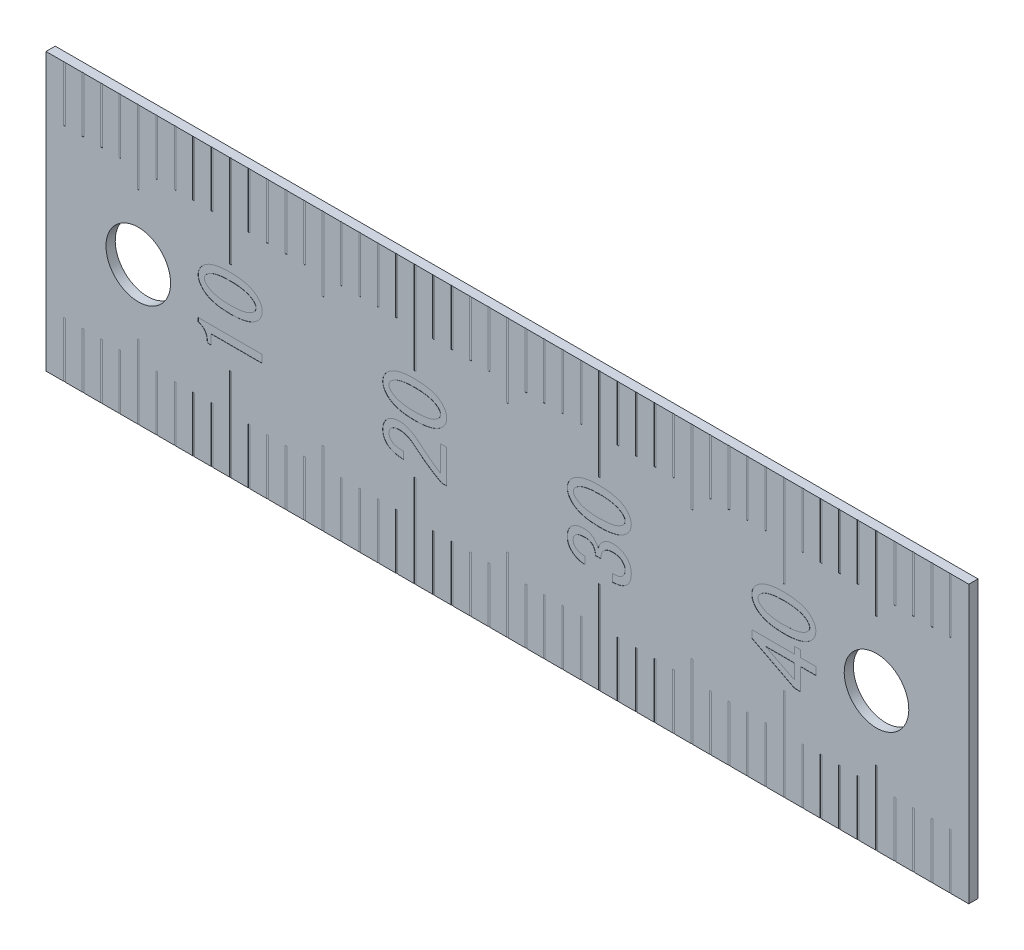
from build123d import *

# Parameters (mm, degrees)
SKETCH1_W             = 15
SKETCH1_H             = 50
EXTRUDE1_DEPTH        = 0.5
SKETCH2_R             = 1.75
EXTRUDE2_DEPTH        = 53.203927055
EXTRUDE3_DEPTH        = 0.01
SKETCH4_W             = 5
SKETCH4_H             = 0.1
SKETCH4_W_2           = 3
SKETCH4_W_3           = 4
EXTRUDE4_DEPTH        = 0.01
BODY_MOVE_COPY2_ANGLE = 90


with BuildPart() as part:
    # Sketch1 → Extrude1 (new body)
    with BuildSketch(Plane.XY):
        with Locations((7.5, 25)):
            Rectangle(SKETCH1_W, SKETCH1_H)
    extrude(amount=EXTRUDE1_DEPTH)

    # Sketch2 → Extrude2 (cut, through all)
    with BuildSketch(Plane.XY.offset(0.5)):
        with Locations((7.5, 5)):
            Circle(SKETCH2_R)
        with Locations((7.5, 45)):
            Circle(SKETCH2_R)
    extrude(amount=-EXTRUDE2_DEPTH, mode=Mode.SUBTRACT)

    # Sketch3 → Extrude3 (cut)
    # profile 1 of 8: a face of its own
    with BuildSketch(Plane.XY.offset(0.5)):
        with BuildLine():
            Line((6.216949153, 38.286911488), (6.216949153, 39.673728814))
            Line((6.216949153, 39.673728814), (6.216949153, 41.047363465))
            Line((6.216949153, 41.047363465), (5.694915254, 41.047363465))
            Line((5.694915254, 41.047363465), (5.694915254, 41.257627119))
            add(Edge.make_bspline(
                [(5.694915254, 41.257627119), (5.720192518, 41.257994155), (5.769501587, 41.258710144), (5.841506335, 41.264639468), (5.909427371, 41.274751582), (5.973597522, 41.287199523), (6.033192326, 41.305760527), (6.089497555, 41.326036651), (6.140930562, 41.352332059), (6.188863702, 41.381188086), (6.232582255, 41.414355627), (6.272352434, 41.451440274), (6.308137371, 41.492533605), (6.339819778, 41.537640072), (6.367821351, 41.586476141), (6.390300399, 41.6396652), (6.41097118, 41.695912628), (6.419965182, 41.735590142), (6.424576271, 41.755932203)],
                knots=[0, 0, 0, 0, 1.25074981, 2.439872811, 3.57154149, 4.648346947, 5.66994637, 6.657420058, 7.60556447, 8.522977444, 9.423221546, 10.315552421, 11.209471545, 12.114430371, 13.03954205, 13.988932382, 14.968956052, 16, 16, 16, 16], degree=3))
            Line((6.424576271, 41.755932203), (6.638135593, 41.755932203))
            Line((6.638135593, 41.755932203), (6.638135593, 38.286911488))
            Line((6.638135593, 38.286911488), (6.216949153, 38.286911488))
        make_face()
    # profile 2 of 8: a face of its own
    with BuildSketch(Plane.XY.offset(0.5)):
        with BuildLine():
            add(Edge.make_bspline(
                [(7.670338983, 40.029661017), (7.670829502, 40.072507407), (7.671793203, 40.156685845), (7.676090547, 40.280686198), (7.684705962, 40.399825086), (7.696795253, 40.514071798), (7.710795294, 40.623684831), (7.729370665, 40.728309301), (7.751095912, 40.828149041), (7.77597959, 40.922993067), (7.804365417, 41.012966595), (7.836057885, 41.098089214), (7.870573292, 41.178755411), (7.909950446, 41.253817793), (7.951116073, 41.324637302), (7.996213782, 41.390336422), (8.044897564, 41.450979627), (8.080073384, 41.488323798), (8.097457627, 41.506779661)],
                knots=[0, 0, 0, 0, 1.305427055, 2.564715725, 3.779397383, 4.943659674, 6.064530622, 7.145206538, 8.1798118, 9.17670212, 10.131464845, 11.052792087, 11.943155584, 12.802378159, 13.633530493, 14.437472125, 15.227783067, 16, 16, 16, 16], degree=3))
            add(Edge.make_bspline(
                [(8.097457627, 41.506779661), (8.118189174, 41.526742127), (8.158560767, 41.565616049), (8.223990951, 41.6159742), (8.29062965, 41.658865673), (8.358609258, 41.695138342), (8.429073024, 41.722269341), (8.501187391, 41.741138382), (8.574673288, 41.753722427), (8.624274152, 41.755194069), (8.649152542, 41.755932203)],
                knots=[0, 0, 0, 0, 1.110117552, 2.161788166, 3.18031983, 4.16653166, 5.130321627, 6.086809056, 7.040397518, 8, 8, 8, 8], degree=3))
            add(Edge.make_bspline(
                [(8.649152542, 41.755932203), (8.674030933, 41.755194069), (8.723631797, 41.753722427), (8.797117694, 41.741138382), (8.869232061, 41.722269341), (8.939695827, 41.695138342), (9.007675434, 41.658865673), (9.074314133, 41.6159742), (9.139744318, 41.565616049), (9.18011591, 41.526742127), (9.200847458, 41.506779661)],
                knots=[0, 0, 0, 0, 0.959602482, 1.913190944, 2.869678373, 3.83346834, 4.81968017, 5.838211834, 6.889882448, 8, 8, 8, 8], degree=3))
            add(Edge.make_bspline(
                [(9.200847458, 41.506779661), (9.218227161, 41.488321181), (9.253393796, 41.450971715), (9.302148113, 41.39036917), (9.347032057, 41.324417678), (9.389280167, 41.254207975), (9.427522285, 41.17853116), (9.462317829, 41.098126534), (9.493918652, 41.012955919), (9.522335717, 40.922996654), (9.547189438, 40.828145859), (9.569006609, 40.728318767), (9.587229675, 40.623619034), (9.602638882, 40.514179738), (9.613279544, 40.399768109), (9.622305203, 40.280696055), (9.626487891, 40.156683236), (9.62746749, 40.072506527), (9.627966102, 40.029661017)],
                knots=[0, 0, 0, 0, 0.772188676, 1.562470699, 2.366382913, 3.20092084, 4.057056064, 4.947386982, 5.868680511, 6.823408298, 7.82026214, 8.854829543, 9.935465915, 11.057194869, 12.220740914, 13.435378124, 14.694620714, 16, 16, 16, 16], degree=3))
            add(Edge.make_bspline(
                [(9.627966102, 40.029661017), (9.627467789, 39.985936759), (9.62649093, 39.900222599), (9.622328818, 39.774232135), (9.613247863, 39.653405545), (9.602616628, 39.537241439), (9.587362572, 39.426237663), (9.568912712, 39.320259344), (9.547201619, 39.219315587), (9.522309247, 39.123160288), (9.494041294, 39.032051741), (9.462303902, 38.946046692), (9.427521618, 38.864982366), (9.389289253, 38.788641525), (9.347004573, 38.717800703), (9.302346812, 38.651238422), (9.253373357, 38.590568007), (9.218220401, 38.553208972), (9.200847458, 38.534745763)],
                knots=[0, 0, 0, 0, 1.317726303, 2.583183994, 3.797878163, 4.968595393, 6.097857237, 7.173314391, 8.20962062, 9.208490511, 10.165515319, 11.083041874, 11.969809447, 12.822581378, 13.653772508, 14.454446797, 15.23617212, 16, 16, 16, 16], degree=3))
            add(Edge.make_bspline(
                [(9.200847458, 38.534745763), (9.180085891, 38.515033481), (9.139553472, 38.476549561), (9.074305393, 38.426244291), (9.007859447, 38.383179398), (8.939507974, 38.347848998), (8.869256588, 38.320526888), (8.797111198, 38.30171788), (8.723633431, 38.289118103), (8.674031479, 38.287648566), (8.649152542, 38.286911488)],
                knots=[0, 0, 0, 0, 1.105704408, 2.15864601, 3.178408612, 4.161898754, 5.126853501, 6.084496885, 7.039237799, 8, 8, 8, 8], degree=3))
            add(Edge.make_bspline(
                [(8.649152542, 38.286911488), (8.624273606, 38.287648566), (8.574671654, 38.289118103), (8.501193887, 38.30171788), (8.429048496, 38.320526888), (8.358797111, 38.347848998), (8.290445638, 38.383179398), (8.223999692, 38.426244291), (8.158751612, 38.476549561), (8.118219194, 38.515033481), (8.097457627, 38.534745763)],
                knots=[0, 0, 0, 0, 0.960762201, 1.915503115, 2.873146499, 3.838101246, 4.821591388, 5.84135399, 6.894295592, 8, 8, 8, 8], degree=3))
            add(Edge.make_bspline(
                [(8.097457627, 38.534745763), (8.080080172, 38.553206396), (8.044918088, 38.590560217), (7.996014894, 38.65127076), (7.951141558, 38.717581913), (7.909944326, 38.789029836), (7.870572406, 38.864759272), (7.836072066, 38.946083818), (7.804242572, 39.032041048), (7.77600611, 39.123163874), (7.751083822, 39.219312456), (7.729463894, 39.320268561), (7.71066559, 39.426173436), (7.696818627, 39.537347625), (7.684739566, 39.65334975), (7.67606663, 39.77424179), (7.671790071, 39.900220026), (7.67082916, 39.98593589), (7.670338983, 40.029661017)],
                knots=[0, 0, 0, 0, 0.763855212, 1.545608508, 2.346311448, 3.174176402, 4.029980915, 4.916780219, 5.834339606, 6.79139866, 7.790304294, 8.826647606, 9.902143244, 11.030571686, 12.201985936, 13.416723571, 14.682226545, 16, 16, 16, 16], degree=3))
        make_face()
        with BuildLine():
            add(Edge.make_bspline(
                [(9.218644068, 40.029661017), (9.218401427, 40.06811401), (9.217925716, 40.143502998), (9.213890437, 40.254274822), (9.207394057, 40.36043931), (9.19820924, 40.461995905), (9.186467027, 40.558736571), (9.171997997, 40.650645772), (9.154788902, 40.737919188), (9.135417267, 40.820493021), (9.112729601, 40.898295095), (9.087786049, 40.971360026), (9.060527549, 41.040128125), (9.029099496, 41.103353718), (8.996371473, 41.162419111), (8.960630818, 41.216569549), (8.922584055, 41.266432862), (8.894393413, 41.296304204), (8.880508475, 41.311016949)],
                knots=[0, 0, 0, 0, 1.361121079, 2.668545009, 3.923107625, 5.125754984, 6.277561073, 7.372066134, 8.418398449, 9.425734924, 10.373324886, 11.2857946, 12.158104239, 12.989405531, 13.783340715, 14.546945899, 15.284316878, 16, 16, 16, 16], degree=3))
            add(Edge.make_bspline(
                [(8.880508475, 41.311016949), (8.862804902, 41.327301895), (8.828895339, 41.358494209), (8.771271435, 41.392758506), (8.711034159, 41.414027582), (8.669751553, 41.416541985), (8.649152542, 41.41779661)],
                knots=[0, 0, 0, 0, 1.101426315, 2.109680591, 3.056776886, 4, 4, 4, 4], degree=3))
            add(Edge.make_bspline(
                [(8.649152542, 41.41779661), (8.628553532, 41.416541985), (8.587270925, 41.414027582), (8.52703365, 41.392758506), (8.469409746, 41.358494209), (8.435500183, 41.327301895), (8.41779661, 41.311016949)],
                knots=[0, 0, 0, 0, 0.943223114, 1.890319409, 2.898573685, 4, 4, 4, 4], degree=3))
            add(Edge.make_bspline(
                [(8.41779661, 41.311016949), (8.403943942, 41.295612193), (8.375924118, 41.264452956), (8.337429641, 41.213183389), (8.302154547, 41.157195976), (8.269141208, 41.096778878), (8.238105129, 41.032500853), (8.210344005, 40.963298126), (8.185591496, 40.889711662), (8.163077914, 40.811655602), (8.143495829, 40.72935949), (8.126232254, 40.642529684), (8.111958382, 40.551250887), (8.100069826, 40.455410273), (8.090947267, 40.355384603), (8.084385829, 40.25076225), (8.080392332, 40.141745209), (8.07990761, 40.067454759), (8.079661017, 40.029661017)],
                knots=[0, 0, 0, 0, 0.733849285, 1.48435867, 2.268363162, 3.076728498, 3.92289974, 4.796109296, 5.716889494, 6.672935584, 7.673739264, 8.713513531, 9.809147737, 10.946688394, 12.135070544, 13.36761715, 14.660829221, 16, 16, 16, 16], degree=3))
            add(Edge.make_bspline(
                [(8.079661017, 40.029661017), (8.079901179, 39.99032918), (8.080370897, 39.913402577), (8.084420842, 39.800434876), (8.090885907, 39.692511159), (8.100090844, 39.589417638), (8.111903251, 39.491150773), (8.126256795, 39.397688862), (8.14342239, 39.309080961), (8.163018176, 39.225467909), (8.185450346, 39.146714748), (8.21053616, 39.072812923), (8.237777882, 39.003387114), (8.269201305, 38.93949489), (8.301960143, 38.879799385), (8.3374802, 38.825046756), (8.375740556, 38.775105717), (8.403918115, 38.745225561), (8.41779661, 38.730508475)],
                knots=[0, 0, 0, 0, 1.374671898, 2.688632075, 3.950368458, 5.153146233, 6.305673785, 7.409137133, 8.457347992, 9.459453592, 10.409852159, 11.318084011, 12.186518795, 13.014240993, 13.804868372, 14.565269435, 15.2933419, 16, 16, 16, 16], degree=3))
            add(Edge.make_bspline(
                [(8.41779661, 38.730508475), (8.43545363, 38.714135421), (8.469192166, 38.68285025), (8.527371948, 38.649736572), (8.587110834, 38.627272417), (8.628524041, 38.624907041), (8.649152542, 38.623728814)],
                knots=[0, 0, 0, 0, 1.101932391, 2.105541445, 3.0563435, 4, 4, 4, 4], degree=3))
            add(Edge.make_bspline(
                [(8.649152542, 38.623728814), (8.669781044, 38.624907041), (8.711194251, 38.627272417), (8.770933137, 38.649736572), (8.829112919, 38.68285025), (8.862851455, 38.714135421), (8.880508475, 38.730508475)],
                knots=[0, 0, 0, 0, 0.9436565, 1.894458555, 2.898067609, 4, 4, 4, 4], degree=3))
            add(Edge.make_bspline(
                [(8.880508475, 38.730508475), (8.894386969, 38.745225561), (8.922564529, 38.775105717), (8.960824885, 38.825046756), (8.996344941, 38.879799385), (9.02910378, 38.93949489), (9.060527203, 39.003387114), (9.087768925, 39.072812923), (9.112854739, 39.146714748), (9.135286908, 39.225467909), (9.154882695, 39.309080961), (9.17204829, 39.397688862), (9.186401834, 39.491150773), (9.198214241, 39.589417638), (9.207419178, 39.692511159), (9.213884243, 39.800434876), (9.217934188, 39.913402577), (9.218403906, 39.99032918), (9.218644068, 40.029661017)],
                knots=[0, 0, 0, 0, 0.7066581, 1.434730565, 2.195131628, 2.985759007, 3.813481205, 4.681915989, 5.590147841, 6.540546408, 7.542652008, 8.590862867, 9.694326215, 10.846853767, 12.049631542, 13.311367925, 14.625328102, 16, 16, 16, 16], degree=3))
        make_face(mode=Mode.SUBTRACT)
    # profile 3 of 8: a face of its own
    with BuildSketch(Plane.XY.offset(0.5)):
        with BuildLine():
            Line((7.278813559, 28.623728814), (7.278813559, 28.286911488))
            Line((7.278813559, 28.286911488), (5.463559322, 28.286911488))
            Line((5.463559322, 28.286911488), (5.463559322, 28.570338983))
            add(Edge.make_bspline(
                [(5.463559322, 28.570338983), (5.498324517, 28.634054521), (5.567960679, 28.761679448), (5.6797878, 28.949763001), (5.797762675, 29.135242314), (5.921134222, 29.319023), (6.051060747, 29.500356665), (6.187539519, 29.679151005), (6.329169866, 29.856558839), (6.428173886, 29.971735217), (6.477966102, 30.029661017)],
                knots=[0, 0, 0, 0, 0.978031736, 1.959039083, 2.947962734, 3.93993095, 4.941489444, 5.953491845, 6.970747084, 8, 8, 8, 8], degree=3))
            add(Edge.make_bspline(
                [(6.477966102, 30.029661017), (6.504874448, 30.061981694), (6.557570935, 30.125277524), (6.625963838, 30.22552891), (6.685342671, 30.326165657), (6.73277714, 30.428761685), (6.770085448, 30.531939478), (6.79666245, 30.636312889), (6.813029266, 30.741883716), (6.815078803, 30.81287462), (6.816101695, 30.848305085)],
                knots=[0, 0, 0, 0, 1.114457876, 2.182520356, 3.213612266, 4.209190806, 5.174713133, 6.118499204, 7.060971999, 8, 8, 8, 8], degree=3))
            add(Edge.make_bspline(
                [(6.816101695, 30.848305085), (6.815559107, 30.872710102), (6.814500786, 30.920312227), (6.807348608, 30.989563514), (6.795005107, 31.054485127), (6.777072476, 31.114656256), (6.754722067, 31.170714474), (6.726863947, 31.222057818), (6.694761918, 31.269704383), (6.668847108, 31.297276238), (6.655932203, 31.311016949)],
                knots=[0, 0, 0, 0, 1.165236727, 2.272800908, 3.320045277, 4.315844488, 5.266523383, 6.195893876, 7.100905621, 8, 8, 8, 8], degree=3))
            add(Edge.make_bspline(
                [(6.655932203, 31.311016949), (6.637239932, 31.327523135), (6.599842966, 31.360546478), (6.531033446, 31.394311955), (6.453848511, 31.414407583), (6.399440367, 31.416638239), (6.371186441, 31.41779661)],
                knots=[0, 0, 0, 0, 0.955281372, 1.911197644, 2.915293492, 4, 4, 4, 4], degree=3))
            add(Edge.make_bspline(
                [(6.371186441, 31.41779661), (6.347195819, 31.416178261), (6.297727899, 31.412841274), (6.225461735, 31.382877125), (6.152812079, 31.338256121), (6.109457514, 31.297213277), (6.086440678, 31.275423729)],
                knots=[0, 0, 0, 0, 0.878616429, 1.811679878, 2.838226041, 4, 4, 4, 4], degree=3))
            add(Edge.make_bspline(
                [(6.086440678, 31.275423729), (6.073340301, 31.260682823), (6.045878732, 31.229782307), (6.014541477, 31.172297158), (5.986374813, 31.105787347), (5.964776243, 31.028130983), (5.94696429, 30.940279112), (5.93484749, 30.841778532), (5.927790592, 30.732841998), (5.926792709, 30.656728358), (5.926271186, 30.616949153)],
                knots=[0, 0, 0, 0, 0.681736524, 1.429085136, 2.255271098, 3.183361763, 4.217126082, 5.361292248, 6.620934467, 8, 8, 8, 8], degree=3))
            Line((5.926271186, 30.616949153), (5.534745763, 30.616949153))
            add(Edge.make_bspline(
                [(5.534745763, 30.616949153), (5.536884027, 30.66863478), (5.541007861, 30.768315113), (5.558612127, 30.912051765), (5.583001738, 31.044849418), (5.616433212, 31.166713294), (5.65853644, 31.277386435), (5.708899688, 31.377100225), (5.76680797, 31.466726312), (5.814114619, 31.517500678), (5.837288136, 31.542372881)],
                knots=[0, 0, 0, 0, 1.245503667, 2.402064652, 3.484583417, 4.495008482, 5.441434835, 6.331296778, 7.18257321, 8, 8, 8, 8], degree=3))
            add(Edge.make_bspline(
                [(5.837288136, 31.542372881), (5.855355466, 31.559530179), (5.891481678, 31.59383675), (5.952345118, 31.636812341), (6.017267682, 31.673649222), (6.086296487, 31.704053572), (6.160486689, 31.726963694), (6.23848039, 31.744157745), (6.321272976, 31.754149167), (6.377750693, 31.755326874), (6.406779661, 31.755932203)],
                knots=[0, 0, 0, 0, 0.956098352, 1.911749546, 2.852903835, 3.820445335, 4.802783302, 5.830866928, 6.885087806, 8, 8, 8, 8], degree=3))
            add(Edge.make_bspline(
                [(6.406779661, 31.755932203), (6.434511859, 31.755465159), (6.488898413, 31.754549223), (6.568647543, 31.742396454), (6.645518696, 31.725279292), (6.718634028, 31.699145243), (6.788555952, 31.666787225), (6.854994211, 31.626731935), (6.918272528, 31.579565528), (6.956845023, 31.542994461), (6.976271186, 31.524576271)],
                knots=[0, 0, 0, 0, 1.052697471, 2.0644807, 3.058754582, 4.040933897, 5.00824168, 5.981797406, 6.983577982, 8, 8, 8, 8], degree=3))
            add(Edge.make_bspline(
                [(6.976271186, 31.524576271), (6.996442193, 31.503333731), (7.036747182, 31.460887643), (7.086228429, 31.387922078), (7.129704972, 31.310266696), (7.165542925, 31.226217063), (7.192177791, 31.135640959), (7.211123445, 31.039204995), (7.223336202, 30.93694094), (7.224716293, 30.866577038), (7.225423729, 30.830508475)],
                knots=[0, 0, 0, 0, 0.926985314, 1.852269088, 2.78426235, 3.745226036, 4.741005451, 5.770682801, 6.857251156, 8, 8, 8, 8], degree=3))
            add(Edge.make_bspline(
                [(7.225423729, 30.830508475), (7.224123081, 30.78711896), (7.22149698, 30.699512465), (7.196723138, 30.568153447), (7.15916462, 30.435936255), (7.106444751, 30.302352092), (7.03809091, 30.168153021), (6.955017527, 30.032587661), (6.857509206, 29.895754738), (6.783147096, 29.80788724), (6.744915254, 29.762711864)],
                knots=[0, 0, 0, 0, 0.869828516, 1.756245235, 2.673055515, 3.625149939, 4.632616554, 5.691117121, 6.812932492, 8, 8, 8, 8], degree=3))
            add(Edge.make_bspline(
                [(6.744915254, 29.762711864), (6.702546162, 29.714094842), (6.618868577, 29.618077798), (6.498015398, 29.472973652), (6.383790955, 29.32848106), (6.273558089, 29.186027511), (6.170111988, 29.043752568), (6.070683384, 28.903421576), (5.977731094, 28.76382659), (5.919441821, 28.670019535), (5.890677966, 28.623728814)],
                knots=[0, 0, 0, 0, 1.085774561, 2.144369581, 3.179090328, 4.186843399, 5.176841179, 6.140565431, 7.082429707, 8, 8, 8, 8], degree=3))
            Line((5.890677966, 28.623728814), (7.278813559, 28.623728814))
        make_face()
    # profile 4 of 8: a face of its own
    with BuildSketch(Plane.XY.offset(0.5)):
        with BuildLine():
            add(Edge.make_bspline(
                [(7.670338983, 30.029661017), (7.670829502, 30.072507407), (7.671793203, 30.156685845), (7.676090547, 30.280686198), (7.684705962, 30.399825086), (7.696795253, 30.514071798), (7.710795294, 30.623684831), (7.729370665, 30.728309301), (7.751095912, 30.828149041), (7.77597959, 30.922993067), (7.804365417, 31.012966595), (7.836057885, 31.098089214), (7.870573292, 31.178755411), (7.909950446, 31.253817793), (7.951116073, 31.324637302), (7.996213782, 31.390336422), (8.044897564, 31.450979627), (8.080073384, 31.488323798), (8.097457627, 31.506779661)],
                knots=[0, 0, 0, 0, 1.305427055, 2.564715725, 3.779397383, 4.943659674, 6.064530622, 7.145206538, 8.1798118, 9.17670212, 10.131464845, 11.052792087, 11.943155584, 12.802378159, 13.633530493, 14.437472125, 15.227783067, 16, 16, 16, 16], degree=3))
            add(Edge.make_bspline(
                [(8.097457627, 31.506779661), (8.118189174, 31.526742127), (8.158560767, 31.565616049), (8.223990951, 31.6159742), (8.29062965, 31.658865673), (8.358609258, 31.695138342), (8.429073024, 31.722269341), (8.501187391, 31.741138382), (8.574673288, 31.753722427), (8.624274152, 31.755194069), (8.649152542, 31.755932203)],
                knots=[0, 0, 0, 0, 1.110117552, 2.161788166, 3.18031983, 4.16653166, 5.130321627, 6.086809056, 7.040397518, 8, 8, 8, 8], degree=3))
            add(Edge.make_bspline(
                [(8.649152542, 31.755932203), (8.674030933, 31.755194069), (8.723631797, 31.753722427), (8.797117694, 31.741138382), (8.869232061, 31.722269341), (8.939695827, 31.695138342), (9.007675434, 31.658865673), (9.074314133, 31.6159742), (9.139744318, 31.565616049), (9.18011591, 31.526742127), (9.200847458, 31.506779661)],
                knots=[0, 0, 0, 0, 0.959602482, 1.913190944, 2.869678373, 3.83346834, 4.81968017, 5.838211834, 6.889882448, 8, 8, 8, 8], degree=3))
            add(Edge.make_bspline(
                [(9.200847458, 31.506779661), (9.218227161, 31.488321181), (9.253393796, 31.450971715), (9.302148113, 31.39036917), (9.347032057, 31.324417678), (9.389280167, 31.254207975), (9.427522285, 31.17853116), (9.462317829, 31.098126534), (9.493918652, 31.012955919), (9.522335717, 30.922996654), (9.547189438, 30.828145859), (9.569006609, 30.728318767), (9.587229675, 30.623619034), (9.602638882, 30.514179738), (9.613279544, 30.399768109), (9.622305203, 30.280696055), (9.626487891, 30.156683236), (9.62746749, 30.072506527), (9.627966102, 30.029661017)],
                knots=[0, 0, 0, 0, 0.772188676, 1.562470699, 2.366382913, 3.20092084, 4.057056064, 4.947386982, 5.868680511, 6.823408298, 7.82026214, 8.854829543, 9.935465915, 11.057194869, 12.220740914, 13.435378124, 14.694620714, 16, 16, 16, 16], degree=3))
            add(Edge.make_bspline(
                [(9.627966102, 30.029661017), (9.627467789, 29.985936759), (9.62649093, 29.900222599), (9.622328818, 29.774232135), (9.613247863, 29.653405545), (9.602616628, 29.537241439), (9.587362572, 29.426237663), (9.568912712, 29.320259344), (9.547201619, 29.219315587), (9.522309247, 29.123160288), (9.494041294, 29.032051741), (9.462303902, 28.946046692), (9.427521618, 28.864982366), (9.389289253, 28.788641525), (9.347004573, 28.717800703), (9.302346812, 28.651238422), (9.253373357, 28.590568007), (9.218220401, 28.553208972), (9.200847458, 28.534745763)],
                knots=[0, 0, 0, 0, 1.317726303, 2.583183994, 3.797878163, 4.968595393, 6.097857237, 7.173314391, 8.20962062, 9.208490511, 10.165515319, 11.083041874, 11.969809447, 12.822581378, 13.653772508, 14.454446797, 15.23617212, 16, 16, 16, 16], degree=3))
            add(Edge.make_bspline(
                [(9.200847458, 28.534745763), (9.180085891, 28.515033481), (9.139553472, 28.476549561), (9.074305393, 28.426244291), (9.007859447, 28.383179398), (8.939507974, 28.347848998), (8.869256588, 28.320526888), (8.797111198, 28.30171788), (8.723633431, 28.289118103), (8.674031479, 28.287648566), (8.649152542, 28.286911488)],
                knots=[0, 0, 0, 0, 1.105704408, 2.15864601, 3.178408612, 4.161898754, 5.126853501, 6.084496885, 7.039237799, 8, 8, 8, 8], degree=3))
            add(Edge.make_bspline(
                [(8.649152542, 28.286911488), (8.624273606, 28.287648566), (8.574671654, 28.289118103), (8.501193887, 28.30171788), (8.429048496, 28.320526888), (8.358797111, 28.347848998), (8.290445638, 28.383179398), (8.223999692, 28.426244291), (8.158751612, 28.476549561), (8.118219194, 28.515033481), (8.097457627, 28.534745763)],
                knots=[0, 0, 0, 0, 0.960762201, 1.915503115, 2.873146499, 3.838101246, 4.821591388, 5.84135399, 6.894295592, 8, 8, 8, 8], degree=3))
            add(Edge.make_bspline(
                [(8.097457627, 28.534745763), (8.080080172, 28.553206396), (8.044918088, 28.590560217), (7.996014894, 28.65127076), (7.951141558, 28.717581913), (7.909944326, 28.789029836), (7.870572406, 28.864759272), (7.836072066, 28.946083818), (7.804242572, 29.032041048), (7.77600611, 29.123163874), (7.751083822, 29.219312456), (7.729463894, 29.320268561), (7.71066559, 29.426173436), (7.696818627, 29.537347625), (7.684739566, 29.65334975), (7.67606663, 29.77424179), (7.671790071, 29.900220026), (7.67082916, 29.98593589), (7.670338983, 30.029661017)],
                knots=[0, 0, 0, 0, 0.763855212, 1.545608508, 2.346311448, 3.174176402, 4.029980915, 4.916780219, 5.834339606, 6.79139866, 7.790304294, 8.826647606, 9.902143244, 11.030571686, 12.201985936, 13.416723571, 14.682226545, 16, 16, 16, 16], degree=3))
        make_face()
        with BuildLine():
            add(Edge.make_bspline(
                [(9.218644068, 30.029661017), (9.218401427, 30.06811401), (9.217925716, 30.143502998), (9.213890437, 30.254274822), (9.207394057, 30.36043931), (9.19820924, 30.461995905), (9.186467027, 30.558736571), (9.171997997, 30.650645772), (9.154788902, 30.737919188), (9.135417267, 30.820493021), (9.112729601, 30.898295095), (9.087786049, 30.971360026), (9.060527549, 31.040128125), (9.029099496, 31.103353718), (8.996371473, 31.162419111), (8.960630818, 31.216569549), (8.922584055, 31.266432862), (8.894393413, 31.296304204), (8.880508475, 31.311016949)],
                knots=[0, 0, 0, 0, 1.361121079, 2.668545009, 3.923107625, 5.125754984, 6.277561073, 7.372066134, 8.418398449, 9.425734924, 10.373324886, 11.2857946, 12.158104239, 12.989405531, 13.783340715, 14.546945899, 15.284316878, 16, 16, 16, 16], degree=3))
            add(Edge.make_bspline(
                [(8.880508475, 31.311016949), (8.862804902, 31.327301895), (8.828895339, 31.358494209), (8.771271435, 31.392758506), (8.711034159, 31.414027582), (8.669751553, 31.416541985), (8.649152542, 31.41779661)],
                knots=[0, 0, 0, 0, 1.101426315, 2.109680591, 3.056776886, 4, 4, 4, 4], degree=3))
            add(Edge.make_bspline(
                [(8.649152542, 31.41779661), (8.628553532, 31.416541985), (8.587270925, 31.414027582), (8.52703365, 31.392758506), (8.469409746, 31.358494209), (8.435500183, 31.327301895), (8.41779661, 31.311016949)],
                knots=[0, 0, 0, 0, 0.943223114, 1.890319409, 2.898573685, 4, 4, 4, 4], degree=3))
            add(Edge.make_bspline(
                [(8.41779661, 31.311016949), (8.403943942, 31.295612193), (8.375924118, 31.264452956), (8.337429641, 31.213183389), (8.302154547, 31.157195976), (8.269141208, 31.096778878), (8.238105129, 31.032500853), (8.210344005, 30.963298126), (8.185591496, 30.889711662), (8.163077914, 30.811655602), (8.143495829, 30.72935949), (8.126232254, 30.642529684), (8.111958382, 30.551250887), (8.100069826, 30.455410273), (8.090947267, 30.355384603), (8.084385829, 30.25076225), (8.080392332, 30.141745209), (8.07990761, 30.067454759), (8.079661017, 30.029661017)],
                knots=[0, 0, 0, 0, 0.733849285, 1.48435867, 2.268363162, 3.076728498, 3.92289974, 4.796109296, 5.716889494, 6.672935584, 7.673739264, 8.713513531, 9.809147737, 10.946688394, 12.135070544, 13.36761715, 14.660829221, 16, 16, 16, 16], degree=3))
            add(Edge.make_bspline(
                [(8.079661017, 30.029661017), (8.079901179, 29.99032918), (8.080370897, 29.913402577), (8.084420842, 29.800434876), (8.090885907, 29.692511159), (8.100090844, 29.589417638), (8.111903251, 29.491150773), (8.126256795, 29.397688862), (8.14342239, 29.309080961), (8.163018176, 29.225467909), (8.185450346, 29.146714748), (8.21053616, 29.072812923), (8.237777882, 29.003387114), (8.269201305, 28.93949489), (8.301960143, 28.879799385), (8.3374802, 28.825046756), (8.375740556, 28.775105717), (8.403918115, 28.745225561), (8.41779661, 28.730508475)],
                knots=[0, 0, 0, 0, 1.374671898, 2.688632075, 3.950368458, 5.153146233, 6.305673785, 7.409137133, 8.457347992, 9.459453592, 10.409852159, 11.318084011, 12.186518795, 13.014240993, 13.804868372, 14.565269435, 15.2933419, 16, 16, 16, 16], degree=3))
            add(Edge.make_bspline(
                [(8.41779661, 28.730508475), (8.43545363, 28.714135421), (8.469192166, 28.68285025), (8.527371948, 28.649736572), (8.587110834, 28.627272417), (8.628524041, 28.624907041), (8.649152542, 28.623728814)],
                knots=[0, 0, 0, 0, 1.101932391, 2.105541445, 3.0563435, 4, 4, 4, 4], degree=3))
            add(Edge.make_bspline(
                [(8.649152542, 28.623728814), (8.669781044, 28.624907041), (8.711194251, 28.627272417), (8.770933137, 28.649736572), (8.829112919, 28.68285025), (8.862851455, 28.714135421), (8.880508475, 28.730508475)],
                knots=[0, 0, 0, 0, 0.9436565, 1.894458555, 2.898067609, 4, 4, 4, 4], degree=3))
            add(Edge.make_bspline(
                [(8.880508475, 28.730508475), (8.894386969, 28.745225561), (8.922564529, 28.775105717), (8.960824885, 28.825046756), (8.996344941, 28.879799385), (9.02910378, 28.93949489), (9.060527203, 29.003387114), (9.087768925, 29.072812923), (9.112854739, 29.146714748), (9.135286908, 29.225467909), (9.154882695, 29.309080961), (9.17204829, 29.397688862), (9.186401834, 29.491150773), (9.198214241, 29.589417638), (9.207419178, 29.692511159), (9.213884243, 29.800434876), (9.217934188, 29.913402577), (9.218403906, 29.99032918), (9.218644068, 30.029661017)],
                knots=[0, 0, 0, 0, 0.7066581, 1.434730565, 2.195131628, 2.985759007, 3.813481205, 4.681915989, 5.590147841, 6.540546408, 7.542652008, 8.590862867, 9.694326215, 10.846853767, 12.049631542, 13.311367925, 14.625328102, 16, 16, 16, 16], degree=3))
        make_face(mode=Mode.SUBTRACT)
    # profile 5 of 8: a face of its own
    with BuildSketch(Plane.XY.offset(0.5)):
        with BuildLine():
            add(Edge.make_bspline(
                [(5.855084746, 19.31779661), (5.854237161, 19.286380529), (5.852594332, 19.225488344), (5.856876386, 19.137276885), (5.868367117, 19.055815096), (5.884283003, 18.980780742), (5.907291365, 18.912297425), (5.937126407, 18.851010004), (5.972049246, 18.795439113), (6.000912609, 18.763950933), (6.015254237, 18.748305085)],
                knots=[0, 0, 0, 0, 1.239207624, 2.401892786, 3.477811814, 4.480626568, 5.423235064, 6.318453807, 7.164473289, 8, 8, 8, 8], degree=3))
            add(Edge.make_bspline(
                [(6.015254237, 18.748305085), (6.037095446, 18.728932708), (6.081015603, 18.689977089), (6.162748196, 18.65151788), (6.254479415, 18.62775036), (6.319389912, 18.625111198), (6.353389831, 18.623728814)],
                knots=[0, 0, 0, 0, 0.943344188, 1.896956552, 2.898432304, 4, 4, 4, 4], degree=3))
            add(Edge.make_bspline(
                [(6.353389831, 18.623728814), (6.382885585, 18.625600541), (6.442770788, 18.629400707), (6.530035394, 18.662470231), (6.615193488, 18.713031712), (6.665308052, 18.759558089), (6.691525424, 18.783898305)],
                knots=[0, 0, 0, 0, 0.919697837, 1.867261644, 2.884260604, 4, 4, 4, 4], degree=3))
            add(Edge.make_bspline(
                [(6.691525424, 18.783898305), (6.704506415, 18.798041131), (6.730947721, 18.826849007), (6.762873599, 18.87803764), (6.790850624, 18.93489513), (6.812875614, 18.998785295), (6.830852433, 19.069052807), (6.842953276, 19.14607081), (6.850175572, 19.229773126), (6.851175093, 19.287680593), (6.851694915, 19.31779661)],
                knots=[0, 0, 0, 0, 0.805009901, 1.639744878, 2.523230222, 3.463349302, 4.47308559, 5.567268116, 6.734805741, 8, 8, 8, 8], degree=3))
            add(Edge.make_bspline(
                [(6.851694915, 19.31779661), (6.851030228, 19.341116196), (6.849720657, 19.387060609), (6.840325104, 19.454392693), (6.825098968, 19.518830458), (6.80407704, 19.580614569), (6.776099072, 19.639452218), (6.742223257, 19.695639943), (6.702890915, 19.749647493), (6.671713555, 19.781952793), (6.655932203, 19.798305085)],
                knots=[0, 0, 0, 0, 1.049658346, 2.068044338, 3.05411714, 4.026954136, 5.00039438, 5.980894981, 6.977969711, 8, 8, 8, 8], degree=3))
            add(Edge.make_bspline(
                [(6.655932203, 19.798305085), (6.643689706, 19.809635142), (6.618997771, 19.832486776), (6.576319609, 19.860786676), (6.529139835, 19.884057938), (6.477383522, 19.901482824), (6.421623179, 19.914983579), (6.361288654, 19.922371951), (6.296502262, 19.92600955), (6.251882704, 19.923947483), (6.228813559, 19.922881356)],
                knots=[0, 0, 0, 0, 0.871605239, 1.757943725, 2.667896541, 3.616736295, 4.609341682, 5.664478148, 6.79249158, 8, 8, 8, 8], degree=3))
            Line((6.228813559, 19.922881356), (6.228813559, 20.225423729))
            add(Edge.make_bspline(
                [(6.228813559, 20.225423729), (6.251905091, 20.227382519), (6.296701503, 20.231182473), (6.361634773, 20.240642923), (6.421607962, 20.255530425), (6.477699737, 20.27292487), (6.528907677, 20.295554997), (6.57613528, 20.321174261), (6.618876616, 20.350763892), (6.643673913, 20.374071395), (6.655932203, 20.38559322)],
                knots=[0, 0, 0, 0, 1.193010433, 2.314380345, 3.373317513, 4.371301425, 5.333718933, 6.249965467, 7.134888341, 8, 8, 8, 8], degree=3))
            add(Edge.make_bspline(
                [(6.655932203, 20.38559322), (6.667527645, 20.397801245), (6.691022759, 20.422537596), (6.719260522, 20.465783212), (6.744475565, 20.512503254), (6.7636149, 20.564151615), (6.779886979, 20.620003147), (6.790583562, 20.680329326), (6.797465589, 20.745099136), (6.798018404, 20.789622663), (6.798305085, 20.812711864)],
                knots=[0, 0, 0, 0, 0.872621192, 1.768137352, 2.671468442, 3.624922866, 4.621628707, 5.689026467, 6.801565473, 8, 8, 8, 8], degree=3))
            add(Edge.make_bspline(
                [(6.798305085, 20.812711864), (6.797772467, 20.841289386), (6.796742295, 20.896563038), (6.789606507, 20.97655192), (6.777306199, 21.050680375), (6.759528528, 21.118580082), (6.737339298, 21.180667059), (6.709321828, 21.236148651), (6.677557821, 21.286558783), (6.651119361, 21.314896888), (6.638135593, 21.328813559)],
                knots=[0, 0, 0, 0, 1.237773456, 2.394058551, 3.475172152, 4.488524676, 5.430883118, 6.32465486, 7.177248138, 8, 8, 8, 8], degree=3))
            add(Edge.make_bspline(
                [(6.638135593, 21.328813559), (6.619858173, 21.345254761), (6.583764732, 21.377722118), (6.518584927, 21.411756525), (6.44688644, 21.432032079), (6.396808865, 21.434387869), (6.371186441, 21.43559322)],
                knots=[0, 0, 0, 0, 0.996207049, 1.967265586, 2.959941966, 4, 4, 4, 4], degree=3))
            add(Edge.make_bspline(
                [(6.371186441, 21.43559322), (6.345564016, 21.434387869), (6.295486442, 21.432032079), (6.223787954, 21.411756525), (6.158608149, 21.377722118), (6.122514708, 21.345254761), (6.104237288, 21.328813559)],
                knots=[0, 0, 0, 0, 1.040058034, 2.032734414, 3.003792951, 4, 4, 4, 4], degree=3))
            add(Edge.make_bspline(
                [(6.104237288, 21.328813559), (6.089776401, 21.313325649), (6.060656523, 21.282137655), (6.023858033, 21.228720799), (5.99197489, 21.170117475), (5.965103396, 21.105788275), (5.942469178, 21.036012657), (5.926581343, 20.960375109), (5.914425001, 20.879600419), (5.910499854, 20.823738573), (5.908474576, 20.794915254)],
                knots=[0, 0, 0, 0, 0.873425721, 1.758816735, 2.667665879, 3.622477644, 4.631783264, 5.6899558, 6.808074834, 8, 8, 8, 8], degree=3))
            Line((5.908474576, 20.794915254), (5.516949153, 20.794915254))
            add(Edge.make_bspline(
                [(5.516949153, 20.794915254), (5.519136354, 20.832553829), (5.523428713, 20.906419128), (5.541152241, 21.014153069), (5.565742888, 21.116659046), (5.599421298, 21.213425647), (5.641988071, 21.304205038), (5.692307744, 21.389733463), (5.750770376, 21.470197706), (5.796519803, 21.518246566), (5.819491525, 21.542372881)],
                knots=[0, 0, 0, 0, 1.094560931, 2.148064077, 3.166651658, 4.153716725, 5.118829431, 6.07444051, 7.0331372, 8, 8, 8, 8], degree=3))
            add(Edge.make_bspline(
                [(5.819491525, 21.542372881), (5.837606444, 21.559463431), (5.873568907, 21.593392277), (5.933236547, 21.637089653), (5.997087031, 21.673081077), (6.063953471, 21.704293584), (6.135510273, 21.726605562), (6.210503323, 21.744361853), (6.289639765, 21.75403117), (6.343699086, 21.755291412), (6.371186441, 21.755932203)],
                knots=[0, 0, 0, 0, 0.982869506, 1.951232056, 2.911200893, 3.87414517, 4.85919522, 5.865267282, 6.914559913, 8, 8, 8, 8], degree=3))
            add(Edge.make_bspline(
                [(6.371186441, 21.755932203), (6.400212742, 21.75530941), (6.45690343, 21.754093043), (6.539734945, 21.744312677), (6.617668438, 21.726841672), (6.691695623, 21.704105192), (6.760787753, 21.673425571), (6.826107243, 21.637226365), (6.886527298, 21.593587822), (6.922581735, 21.559488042), (6.940677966, 21.542372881)],
                knots=[0, 0, 0, 0, 1.1148228, 2.177338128, 3.197095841, 4.179355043, 5.146818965, 6.095248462, 7.043978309, 8, 8, 8, 8], degree=3))
            add(Edge.make_bspline(
                [(6.940677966, 21.542372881), (6.960789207, 21.521311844), (7.000715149, 21.479500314), (7.050703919, 21.408467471), (7.093629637, 21.333157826), (7.129597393, 21.253229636), (7.156749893, 21.167830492), (7.175324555, 21.077438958), (7.187735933, 20.982230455), (7.189122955, 20.917115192), (7.189830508, 20.883898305)],
                knots=[0, 0, 0, 0, 0.965213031, 1.916194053, 2.872998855, 3.839092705, 4.81906353, 5.840080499, 6.898172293, 8, 8, 8, 8], degree=3))
            add(Edge.make_bspline(
                [(7.189830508, 20.883898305), (7.189188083, 20.853553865), (7.187942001, 20.794696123), (7.178630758, 20.709388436), (7.163534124, 20.62978595), (7.142688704, 20.555442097), (7.114814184, 20.48659326), (7.081194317, 20.423115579), (7.041799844, 20.364749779), (7.009934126, 20.331141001), (6.994067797, 20.31440678)],
                knots=[0, 0, 0, 0, 1.177909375, 2.284737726, 3.326967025, 4.320553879, 5.277281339, 6.204541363, 7.106019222, 8, 8, 8, 8], degree=3))
            add(Edge.make_bspline(
                [(6.994067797, 20.31440678), (6.965346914, 20.286806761), (6.910623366, 20.23421886), (6.82464357, 20.168038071), (6.741089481, 20.116155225), (6.683328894, 20.093701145), (6.655932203, 20.083050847)],
                knots=[0, 0, 0, 0, 1.156237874, 2.20304646, 3.147678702, 4, 4, 4, 4], degree=3))
            add(Edge.make_bspline(
                [(6.655932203, 20.083050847), (6.692456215, 20.070797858), (6.762638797, 20.04725317), (6.859251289, 20.002078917), (6.942516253, 19.949298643), (6.989290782, 19.907473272), (7.011864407, 19.887288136)],
                knots=[0, 0, 0, 0, 1.127022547, 2.165626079, 3.114721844, 4, 4, 4, 4], degree=3))
            add(Edge.make_bspline(
                [(7.011864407, 19.887288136), (7.031906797, 19.866396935), (7.071315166, 19.82531959), (7.121385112, 19.75713319), (7.164478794, 19.686384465), (7.200684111, 19.612307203), (7.227428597, 19.534251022), (7.246538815, 19.452987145), (7.258829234, 19.368703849), (7.26028238, 19.311247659), (7.261016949, 19.28220339)],
                knots=[0, 0, 0, 0, 1.032403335, 2.029964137, 3.011802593, 3.986915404, 4.966590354, 5.950024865, 6.963731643, 8, 8, 8, 8], degree=3))
            add(Edge.make_bspline(
                [(7.261016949, 19.28220339), (7.260107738, 19.244595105), (7.258326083, 19.170899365), (7.245030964, 19.062972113), (7.222782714, 18.960785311), (7.191569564, 18.864018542), (7.151384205, 18.772986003), (7.102175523, 18.687259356), (7.044331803, 18.606956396), (6.999018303, 18.558879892), (6.976271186, 18.534745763)],
                knots=[0, 0, 0, 0, 1.098385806, 2.152354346, 3.170785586, 4.14905217, 5.117394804, 6.071856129, 7.032082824, 8, 8, 8, 8], degree=3))
            add(Edge.make_bspline(
                [(6.976271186, 18.534745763), (6.95539303, 18.51489658), (6.913980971, 18.475525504), (6.844715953, 18.425961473), (6.772751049, 18.382434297), (6.69643541, 18.347443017), (6.616257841, 18.320218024), (6.532036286, 18.301445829), (6.444059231, 18.289024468), (6.383973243, 18.287624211), (6.353389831, 18.286911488)],
                knots=[0, 0, 0, 0, 1.002941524, 1.989345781, 2.961196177, 3.930871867, 4.909217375, 5.906794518, 6.934570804, 8, 8, 8, 8], degree=3))
            add(Edge.make_bspline(
                [(6.353389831, 18.286911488), (6.320174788, 18.287384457), (6.255300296, 18.288308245), (6.161021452, 18.300136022), (6.072206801, 18.31739535), (5.989040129, 18.342792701), (5.911092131, 18.374810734), (5.838829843, 18.414630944), (5.772044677, 18.461543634), (5.732521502, 18.498450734), (5.712711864, 18.516949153)],
                knots=[0, 0, 0, 0, 1.139704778, 2.226032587, 3.257187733, 4.242744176, 5.206582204, 6.145174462, 7.070332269, 8, 8, 8, 8], degree=3))
            add(Edge.make_bspline(
                [(5.712711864, 18.516949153), (5.691201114, 18.540157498), (5.64795465, 18.586816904), (5.593991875, 18.667318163), (5.547688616, 18.755199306), (5.509997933, 18.851612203), (5.481332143, 18.9564097), (5.460323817, 19.069484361), (5.447736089, 19.190956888), (5.44643317, 19.27470259), (5.445762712, 19.31779661)],
                knots=[0, 0, 0, 0, 0.875500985, 1.760158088, 2.674977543, 3.623303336, 4.621607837, 5.680513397, 6.806434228, 8, 8, 8, 8], degree=3))
            Line((5.445762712, 19.31779661), (5.855084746, 19.31779661))
        make_face()
    # profile 6 of 8: a face of its own
    with BuildSketch(Plane.XY.offset(0.5)):
        with BuildLine():
            add(Edge.make_bspline(
                [(7.670338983, 20.029661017), (7.670829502, 20.072507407), (7.671793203, 20.156685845), (7.676090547, 20.280686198), (7.684705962, 20.399825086), (7.696795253, 20.514071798), (7.710795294, 20.623684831), (7.729370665, 20.728309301), (7.751095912, 20.828149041), (7.77597959, 20.922993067), (7.804365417, 21.012966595), (7.836057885, 21.098089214), (7.870573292, 21.178755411), (7.909950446, 21.253817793), (7.951116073, 21.324637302), (7.996213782, 21.390336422), (8.044897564, 21.450979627), (8.080073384, 21.488323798), (8.097457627, 21.506779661)],
                knots=[0, 0, 0, 0, 1.305427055, 2.564715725, 3.779397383, 4.943659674, 6.064530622, 7.145206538, 8.1798118, 9.17670212, 10.131464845, 11.052792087, 11.943155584, 12.802378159, 13.633530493, 14.437472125, 15.227783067, 16, 16, 16, 16], degree=3))
            add(Edge.make_bspline(
                [(8.097457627, 21.506779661), (8.118189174, 21.526742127), (8.158560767, 21.565616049), (8.223990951, 21.6159742), (8.29062965, 21.658865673), (8.358609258, 21.695138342), (8.429073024, 21.722269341), (8.501187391, 21.741138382), (8.574673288, 21.753722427), (8.624274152, 21.755194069), (8.649152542, 21.755932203)],
                knots=[0, 0, 0, 0, 1.110117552, 2.161788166, 3.18031983, 4.16653166, 5.130321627, 6.086809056, 7.040397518, 8, 8, 8, 8], degree=3))
            add(Edge.make_bspline(
                [(8.649152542, 21.755932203), (8.674030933, 21.755194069), (8.723631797, 21.753722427), (8.797117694, 21.741138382), (8.869232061, 21.722269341), (8.939695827, 21.695138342), (9.007675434, 21.658865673), (9.074314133, 21.6159742), (9.139744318, 21.565616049), (9.18011591, 21.526742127), (9.200847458, 21.506779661)],
                knots=[0, 0, 0, 0, 0.959602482, 1.913190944, 2.869678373, 3.83346834, 4.81968017, 5.838211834, 6.889882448, 8, 8, 8, 8], degree=3))
            add(Edge.make_bspline(
                [(9.200847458, 21.506779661), (9.218227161, 21.488321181), (9.253393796, 21.450971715), (9.302148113, 21.39036917), (9.347032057, 21.324417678), (9.389280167, 21.254207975), (9.427522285, 21.17853116), (9.462317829, 21.098126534), (9.493918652, 21.012955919), (9.522335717, 20.922996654), (9.547189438, 20.828145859), (9.569006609, 20.728318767), (9.587229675, 20.623619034), (9.602638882, 20.514179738), (9.613279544, 20.399768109), (9.622305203, 20.280696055), (9.626487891, 20.156683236), (9.62746749, 20.072506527), (9.627966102, 20.029661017)],
                knots=[0, 0, 0, 0, 0.772188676, 1.562470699, 2.366382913, 3.20092084, 4.057056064, 4.947386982, 5.868680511, 6.823408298, 7.82026214, 8.854829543, 9.935465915, 11.057194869, 12.220740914, 13.435378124, 14.694620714, 16, 16, 16, 16], degree=3))
            add(Edge.make_bspline(
                [(9.627966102, 20.029661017), (9.627467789, 19.985936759), (9.62649093, 19.900222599), (9.622328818, 19.774232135), (9.613247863, 19.653405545), (9.602616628, 19.537241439), (9.587362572, 19.426237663), (9.568912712, 19.320259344), (9.547201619, 19.219315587), (9.522309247, 19.123160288), (9.494041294, 19.032051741), (9.462303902, 18.946046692), (9.427521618, 18.864982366), (9.389289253, 18.788641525), (9.347004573, 18.717800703), (9.302346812, 18.651238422), (9.253373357, 18.590568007), (9.218220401, 18.553208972), (9.200847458, 18.534745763)],
                knots=[0, 0, 0, 0, 1.317726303, 2.583183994, 3.797878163, 4.968595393, 6.097857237, 7.173314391, 8.20962062, 9.208490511, 10.165515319, 11.083041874, 11.969809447, 12.822581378, 13.653772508, 14.454446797, 15.23617212, 16, 16, 16, 16], degree=3))
            add(Edge.make_bspline(
                [(9.200847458, 18.534745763), (9.180085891, 18.515033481), (9.139553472, 18.476549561), (9.074305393, 18.426244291), (9.007859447, 18.383179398), (8.939507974, 18.347848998), (8.869256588, 18.320526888), (8.797111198, 18.30171788), (8.723633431, 18.289118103), (8.674031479, 18.287648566), (8.649152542, 18.286911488)],
                knots=[0, 0, 0, 0, 1.105704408, 2.15864601, 3.178408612, 4.161898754, 5.126853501, 6.084496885, 7.039237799, 8, 8, 8, 8], degree=3))
            add(Edge.make_bspline(
                [(8.649152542, 18.286911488), (8.624273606, 18.287648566), (8.574671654, 18.289118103), (8.501193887, 18.30171788), (8.429048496, 18.320526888), (8.358797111, 18.347848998), (8.290445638, 18.383179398), (8.223999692, 18.426244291), (8.158751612, 18.476549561), (8.118219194, 18.515033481), (8.097457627, 18.534745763)],
                knots=[0, 0, 0, 0, 0.960762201, 1.915503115, 2.873146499, 3.838101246, 4.821591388, 5.84135399, 6.894295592, 8, 8, 8, 8], degree=3))
            add(Edge.make_bspline(
                [(8.097457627, 18.534745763), (8.080080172, 18.553206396), (8.044918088, 18.590560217), (7.996014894, 18.65127076), (7.951141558, 18.717581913), (7.909944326, 18.789029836), (7.870572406, 18.864759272), (7.836072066, 18.946083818), (7.804242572, 19.032041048), (7.77600611, 19.123163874), (7.751083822, 19.219312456), (7.729463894, 19.320268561), (7.71066559, 19.426173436), (7.696818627, 19.537347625), (7.684739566, 19.65334975), (7.67606663, 19.77424179), (7.671790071, 19.900220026), (7.67082916, 19.98593589), (7.670338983, 20.029661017)],
                knots=[0, 0, 0, 0, 0.763855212, 1.545608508, 2.346311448, 3.174176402, 4.029980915, 4.916780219, 5.834339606, 6.79139866, 7.790304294, 8.826647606, 9.902143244, 11.030571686, 12.201985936, 13.416723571, 14.682226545, 16, 16, 16, 16], degree=3))
        make_face()
        with BuildLine():
            add(Edge.make_bspline(
                [(9.218644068, 20.029661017), (9.218401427, 20.06811401), (9.217925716, 20.143502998), (9.213890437, 20.254274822), (9.207394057, 20.36043931), (9.19820924, 20.461995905), (9.186467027, 20.558736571), (9.171997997, 20.650645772), (9.154788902, 20.737919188), (9.135417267, 20.820493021), (9.112729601, 20.898295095), (9.087786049, 20.971360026), (9.060527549, 21.040128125), (9.029099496, 21.103353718), (8.996371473, 21.162419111), (8.960630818, 21.216569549), (8.922584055, 21.266432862), (8.894393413, 21.296304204), (8.880508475, 21.311016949)],
                knots=[0, 0, 0, 0, 1.361121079, 2.668545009, 3.923107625, 5.125754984, 6.277561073, 7.372066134, 8.418398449, 9.425734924, 10.373324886, 11.2857946, 12.158104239, 12.989405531, 13.783340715, 14.546945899, 15.284316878, 16, 16, 16, 16], degree=3))
            add(Edge.make_bspline(
                [(8.880508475, 21.311016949), (8.862804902, 21.327301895), (8.828895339, 21.358494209), (8.771271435, 21.392758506), (8.711034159, 21.414027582), (8.669751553, 21.416541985), (8.649152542, 21.41779661)],
                knots=[0, 0, 0, 0, 1.101426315, 2.109680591, 3.056776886, 4, 4, 4, 4], degree=3))
            add(Edge.make_bspline(
                [(8.649152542, 21.41779661), (8.628553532, 21.416541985), (8.587270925, 21.414027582), (8.52703365, 21.392758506), (8.469409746, 21.358494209), (8.435500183, 21.327301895), (8.41779661, 21.311016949)],
                knots=[0, 0, 0, 0, 0.943223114, 1.890319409, 2.898573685, 4, 4, 4, 4], degree=3))
            add(Edge.make_bspline(
                [(8.41779661, 21.311016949), (8.403943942, 21.295612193), (8.375924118, 21.264452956), (8.337429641, 21.213183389), (8.302154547, 21.157195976), (8.269141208, 21.096778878), (8.238105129, 21.032500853), (8.210344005, 20.963298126), (8.185591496, 20.889711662), (8.163077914, 20.811655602), (8.143495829, 20.72935949), (8.126232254, 20.642529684), (8.111958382, 20.551250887), (8.100069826, 20.455410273), (8.090947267, 20.355384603), (8.084385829, 20.25076225), (8.080392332, 20.141745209), (8.07990761, 20.067454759), (8.079661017, 20.029661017)],
                knots=[0, 0, 0, 0, 0.733849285, 1.48435867, 2.268363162, 3.076728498, 3.92289974, 4.796109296, 5.716889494, 6.672935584, 7.673739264, 8.713513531, 9.809147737, 10.946688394, 12.135070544, 13.36761715, 14.660829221, 16, 16, 16, 16], degree=3))
            add(Edge.make_bspline(
                [(8.079661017, 20.029661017), (8.079901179, 19.99032918), (8.080370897, 19.913402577), (8.084420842, 19.800434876), (8.090885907, 19.692511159), (8.100090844, 19.589417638), (8.111903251, 19.491150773), (8.126256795, 19.397688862), (8.14342239, 19.309080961), (8.163018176, 19.225467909), (8.185450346, 19.146714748), (8.21053616, 19.072812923), (8.237777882, 19.003387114), (8.269201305, 18.93949489), (8.301960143, 18.879799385), (8.3374802, 18.825046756), (8.375740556, 18.775105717), (8.403918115, 18.745225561), (8.41779661, 18.730508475)],
                knots=[0, 0, 0, 0, 1.374671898, 2.688632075, 3.950368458, 5.153146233, 6.305673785, 7.409137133, 8.457347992, 9.459453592, 10.409852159, 11.318084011, 12.186518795, 13.014240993, 13.804868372, 14.565269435, 15.2933419, 16, 16, 16, 16], degree=3))
            add(Edge.make_bspline(
                [(8.41779661, 18.730508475), (8.43545363, 18.714135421), (8.469192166, 18.68285025), (8.527371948, 18.649736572), (8.587110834, 18.627272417), (8.628524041, 18.624907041), (8.649152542, 18.623728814)],
                knots=[0, 0, 0, 0, 1.101932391, 2.105541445, 3.0563435, 4, 4, 4, 4], degree=3))
            add(Edge.make_bspline(
                [(8.649152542, 18.623728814), (8.669781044, 18.624907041), (8.711194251, 18.627272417), (8.770933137, 18.649736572), (8.829112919, 18.68285025), (8.862851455, 18.714135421), (8.880508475, 18.730508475)],
                knots=[0, 0, 0, 0, 0.9436565, 1.894458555, 2.898067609, 4, 4, 4, 4], degree=3))
            add(Edge.make_bspline(
                [(8.880508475, 18.730508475), (8.894386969, 18.745225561), (8.922564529, 18.775105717), (8.960824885, 18.825046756), (8.996344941, 18.879799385), (9.02910378, 18.93949489), (9.060527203, 19.003387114), (9.087768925, 19.072812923), (9.112854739, 19.146714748), (9.135286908, 19.225467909), (9.154882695, 19.309080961), (9.17204829, 19.397688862), (9.186401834, 19.491150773), (9.198214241, 19.589417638), (9.207419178, 19.692511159), (9.213884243, 19.800434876), (9.217934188, 19.913402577), (9.218403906, 19.99032918), (9.218644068, 20.029661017)],
                knots=[0, 0, 0, 0, 0.7066581, 1.434730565, 2.195131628, 2.985759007, 3.813481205, 4.681915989, 5.590147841, 6.540546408, 7.542652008, 8.590862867, 9.694326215, 10.846853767, 12.049631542, 13.311367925, 14.625328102, 16, 16, 16, 16], degree=3))
        make_face(mode=Mode.SUBTRACT)
    # profile 7 of 8: a face of its own
    with BuildSketch(Plane.XY.offset(0.5)):
        Polygon((6.572881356, 8.286911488), (6.572881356, 8.694915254), (6.572881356, 9.105555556), (5.392372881, 9.105555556), (5.392372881, 9.442372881), (6.584745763, 11.755932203), (6.994067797, 11.755932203), (6.994067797, 9.442372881), (7.36779661, 9.442372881), (7.36779661, 9.105555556), (6.994067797, 9.105555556), (6.994067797, 8.286911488), align=None)
        Polygon((6.572881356, 9.442372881), (6.572881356, 11.008474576), (5.783898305, 9.442372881), align=None, mode=Mode.SUBTRACT)
    # profile 8 of 8: a face of its own
    with BuildSketch(Plane.XY.offset(0.5)):
        with BuildLine():
            add(Edge.make_bspline(
                [(7.670338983, 10.029661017), (7.670829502, 10.072507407), (7.671793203, 10.156685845), (7.676090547, 10.280686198), (7.684705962, 10.399825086), (7.696795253, 10.514071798), (7.710795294, 10.623684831), (7.729370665, 10.728309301), (7.751095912, 10.828149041), (7.77597959, 10.922993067), (7.804365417, 11.012966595), (7.836057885, 11.098089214), (7.870573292, 11.178755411), (7.909950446, 11.253817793), (7.951116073, 11.324637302), (7.996213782, 11.390336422), (8.044897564, 11.450979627), (8.080073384, 11.488323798), (8.097457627, 11.506779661)],
                knots=[0, 0, 0, 0, 1.305427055, 2.564715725, 3.779397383, 4.943659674, 6.064530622, 7.145206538, 8.1798118, 9.17670212, 10.131464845, 11.052792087, 11.943155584, 12.802378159, 13.633530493, 14.437472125, 15.227783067, 16, 16, 16, 16], degree=3))
            add(Edge.make_bspline(
                [(8.097457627, 11.506779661), (8.118189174, 11.526742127), (8.158560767, 11.565616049), (8.223990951, 11.6159742), (8.29062965, 11.658865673), (8.358609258, 11.695138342), (8.429073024, 11.722269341), (8.501187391, 11.741138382), (8.574673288, 11.753722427), (8.624274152, 11.755194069), (8.649152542, 11.755932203)],
                knots=[0, 0, 0, 0, 1.110117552, 2.161788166, 3.18031983, 4.16653166, 5.130321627, 6.086809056, 7.040397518, 8, 8, 8, 8], degree=3))
            add(Edge.make_bspline(
                [(8.649152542, 11.755932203), (8.674030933, 11.755194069), (8.723631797, 11.753722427), (8.797117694, 11.741138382), (8.869232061, 11.722269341), (8.939695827, 11.695138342), (9.007675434, 11.658865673), (9.074314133, 11.6159742), (9.139744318, 11.565616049), (9.18011591, 11.526742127), (9.200847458, 11.506779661)],
                knots=[0, 0, 0, 0, 0.959602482, 1.913190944, 2.869678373, 3.83346834, 4.81968017, 5.838211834, 6.889882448, 8, 8, 8, 8], degree=3))
            add(Edge.make_bspline(
                [(9.200847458, 11.506779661), (9.218227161, 11.488321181), (9.253393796, 11.450971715), (9.302148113, 11.39036917), (9.347032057, 11.324417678), (9.389280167, 11.254207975), (9.427522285, 11.17853116), (9.462317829, 11.098126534), (9.493918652, 11.012955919), (9.522335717, 10.922996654), (9.547189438, 10.828145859), (9.569006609, 10.728318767), (9.587229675, 10.623619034), (9.602638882, 10.514179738), (9.613279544, 10.399768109), (9.622305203, 10.280696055), (9.626487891, 10.156683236), (9.62746749, 10.072506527), (9.627966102, 10.029661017)],
                knots=[0, 0, 0, 0, 0.772188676, 1.562470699, 2.366382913, 3.20092084, 4.057056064, 4.947386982, 5.868680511, 6.823408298, 7.82026214, 8.854829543, 9.935465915, 11.057194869, 12.220740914, 13.435378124, 14.694620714, 16, 16, 16, 16], degree=3))
            add(Edge.make_bspline(
                [(9.627966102, 10.029661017), (9.627467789, 9.985936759), (9.62649093, 9.900222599), (9.622328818, 9.774232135), (9.613247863, 9.653405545), (9.602616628, 9.537241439), (9.587362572, 9.426237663), (9.568912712, 9.320259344), (9.547201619, 9.219315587), (9.522309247, 9.123160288), (9.494041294, 9.032051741), (9.462303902, 8.946046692), (9.427521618, 8.864982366), (9.389289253, 8.788641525), (9.347004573, 8.717800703), (9.302346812, 8.651238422), (9.253373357, 8.590568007), (9.218220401, 8.553208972), (9.200847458, 8.534745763)],
                knots=[0, 0, 0, 0, 1.317726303, 2.583183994, 3.797878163, 4.968595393, 6.097857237, 7.173314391, 8.20962062, 9.208490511, 10.165515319, 11.083041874, 11.969809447, 12.822581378, 13.653772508, 14.454446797, 15.23617212, 16, 16, 16, 16], degree=3))
            add(Edge.make_bspline(
                [(9.200847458, 8.534745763), (9.180085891, 8.515033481), (9.139553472, 8.476549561), (9.074305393, 8.426244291), (9.007859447, 8.383179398), (8.939507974, 8.347848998), (8.869256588, 8.320526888), (8.797111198, 8.30171788), (8.723633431, 8.289118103), (8.674031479, 8.287648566), (8.649152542, 8.286911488)],
                knots=[0, 0, 0, 0, 1.105704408, 2.15864601, 3.178408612, 4.161898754, 5.126853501, 6.084496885, 7.039237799, 8, 8, 8, 8], degree=3))
            add(Edge.make_bspline(
                [(8.649152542, 8.286911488), (8.624273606, 8.287648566), (8.574671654, 8.289118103), (8.501193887, 8.30171788), (8.429048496, 8.320526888), (8.358797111, 8.347848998), (8.290445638, 8.383179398), (8.223999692, 8.426244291), (8.158751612, 8.476549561), (8.118219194, 8.515033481), (8.097457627, 8.534745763)],
                knots=[0, 0, 0, 0, 0.960762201, 1.915503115, 2.873146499, 3.838101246, 4.821591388, 5.84135399, 6.894295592, 8, 8, 8, 8], degree=3))
            add(Edge.make_bspline(
                [(8.097457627, 8.534745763), (8.080080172, 8.553206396), (8.044918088, 8.590560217), (7.996014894, 8.65127076), (7.951141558, 8.717581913), (7.909944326, 8.789029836), (7.870572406, 8.864759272), (7.836072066, 8.946083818), (7.804242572, 9.032041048), (7.77600611, 9.123163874), (7.751083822, 9.219312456), (7.729463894, 9.320268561), (7.71066559, 9.426173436), (7.696818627, 9.537347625), (7.684739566, 9.65334975), (7.67606663, 9.77424179), (7.671790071, 9.900220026), (7.67082916, 9.98593589), (7.670338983, 10.029661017)],
                knots=[0, 0, 0, 0, 0.763855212, 1.545608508, 2.346311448, 3.174176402, 4.029980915, 4.916780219, 5.834339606, 6.79139866, 7.790304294, 8.826647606, 9.902143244, 11.030571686, 12.201985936, 13.416723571, 14.682226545, 16, 16, 16, 16], degree=3))
        make_face()
        with BuildLine():
            add(Edge.make_bspline(
                [(9.218644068, 10.029661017), (9.218401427, 10.06811401), (9.217925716, 10.143502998), (9.213890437, 10.254274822), (9.207394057, 10.36043931), (9.19820924, 10.461995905), (9.186467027, 10.558736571), (9.171997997, 10.650645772), (9.154788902, 10.737919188), (9.135417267, 10.820493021), (9.112729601, 10.898295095), (9.087786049, 10.971360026), (9.060527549, 11.040128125), (9.029099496, 11.103353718), (8.996371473, 11.162419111), (8.960630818, 11.216569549), (8.922584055, 11.266432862), (8.894393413, 11.296304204), (8.880508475, 11.311016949)],
                knots=[0, 0, 0, 0, 1.361121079, 2.668545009, 3.923107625, 5.125754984, 6.277561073, 7.372066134, 8.418398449, 9.425734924, 10.373324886, 11.2857946, 12.158104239, 12.989405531, 13.783340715, 14.546945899, 15.284316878, 16, 16, 16, 16], degree=3))
            add(Edge.make_bspline(
                [(8.880508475, 11.311016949), (8.862804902, 11.327301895), (8.828895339, 11.358494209), (8.771271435, 11.392758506), (8.711034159, 11.414027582), (8.669751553, 11.416541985), (8.649152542, 11.41779661)],
                knots=[0, 0, 0, 0, 1.101426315, 2.109680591, 3.056776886, 4, 4, 4, 4], degree=3))
            add(Edge.make_bspline(
                [(8.649152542, 11.41779661), (8.628553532, 11.416541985), (8.587270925, 11.414027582), (8.52703365, 11.392758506), (8.469409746, 11.358494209), (8.435500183, 11.327301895), (8.41779661, 11.311016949)],
                knots=[0, 0, 0, 0, 0.943223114, 1.890319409, 2.898573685, 4, 4, 4, 4], degree=3))
            add(Edge.make_bspline(
                [(8.41779661, 11.311016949), (8.403943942, 11.295612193), (8.375924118, 11.264452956), (8.337429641, 11.213183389), (8.302154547, 11.157195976), (8.269141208, 11.096778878), (8.238105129, 11.032500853), (8.210344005, 10.963298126), (8.185591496, 10.889711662), (8.163077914, 10.811655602), (8.143495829, 10.72935949), (8.126232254, 10.642529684), (8.111958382, 10.551250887), (8.100069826, 10.455410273), (8.090947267, 10.355384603), (8.084385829, 10.25076225), (8.080392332, 10.141745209), (8.07990761, 10.067454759), (8.079661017, 10.029661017)],
                knots=[0, 0, 0, 0, 0.733849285, 1.48435867, 2.268363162, 3.076728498, 3.92289974, 4.796109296, 5.716889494, 6.672935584, 7.673739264, 8.713513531, 9.809147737, 10.946688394, 12.135070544, 13.36761715, 14.660829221, 16, 16, 16, 16], degree=3))
            add(Edge.make_bspline(
                [(8.079661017, 10.029661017), (8.079901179, 9.99032918), (8.080370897, 9.913402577), (8.084420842, 9.800434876), (8.090885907, 9.692511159), (8.100090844, 9.589417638), (8.111903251, 9.491150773), (8.126256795, 9.397688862), (8.14342239, 9.309080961), (8.163018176, 9.225467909), (8.185450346, 9.146714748), (8.21053616, 9.072812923), (8.237777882, 9.003387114), (8.269201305, 8.93949489), (8.301960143, 8.879799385), (8.3374802, 8.825046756), (8.375740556, 8.775105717), (8.403918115, 8.745225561), (8.41779661, 8.730508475)],
                knots=[0, 0, 0, 0, 1.374671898, 2.688632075, 3.950368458, 5.153146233, 6.305673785, 7.409137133, 8.457347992, 9.459453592, 10.409852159, 11.318084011, 12.186518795, 13.014240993, 13.804868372, 14.565269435, 15.2933419, 16, 16, 16, 16], degree=3))
            add(Edge.make_bspline(
                [(8.41779661, 8.730508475), (8.43545363, 8.714135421), (8.469192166, 8.68285025), (8.527371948, 8.649736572), (8.587110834, 8.627272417), (8.628524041, 8.624907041), (8.649152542, 8.623728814)],
                knots=[0, 0, 0, 0, 1.101932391, 2.105541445, 3.0563435, 4, 4, 4, 4], degree=3))
            add(Edge.make_bspline(
                [(8.649152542, 8.623728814), (8.669781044, 8.624907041), (8.711194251, 8.627272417), (8.770933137, 8.649736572), (8.829112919, 8.68285025), (8.862851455, 8.714135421), (8.880508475, 8.730508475)],
                knots=[0, 0, 0, 0, 0.9436565, 1.894458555, 2.898067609, 4, 4, 4, 4], degree=3))
            add(Edge.make_bspline(
                [(8.880508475, 8.730508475), (8.894386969, 8.745225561), (8.922564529, 8.775105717), (8.960824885, 8.825046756), (8.996344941, 8.879799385), (9.02910378, 8.93949489), (9.060527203, 9.003387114), (9.087768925, 9.072812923), (9.112854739, 9.146714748), (9.135286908, 9.225467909), (9.154882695, 9.309080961), (9.17204829, 9.397688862), (9.186401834, 9.491150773), (9.198214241, 9.589417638), (9.207419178, 9.692511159), (9.213884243, 9.800434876), (9.217934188, 9.913402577), (9.218403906, 9.99032918), (9.218644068, 10.029661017)],
                knots=[0, 0, 0, 0, 0.7066581, 1.434730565, 2.195131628, 2.985759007, 3.813481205, 4.681915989, 5.590147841, 6.540546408, 7.542652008, 8.590862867, 9.694326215, 10.846853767, 12.049631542, 13.311367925, 14.625328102, 16, 16, 16, 16], degree=3))
        make_face(mode=Mode.SUBTRACT)
    extrude(amount=-EXTRUDE3_DEPTH, mode=Mode.SUBTRACT)

    # Sketch4 → Extrude4 (cut)
    with BuildSketch(Plane.XY.offset(0.5)):
        with Locations((12.5, 40)):
            Rectangle(SKETCH4_W, SKETCH4_H)
        with Locations((13.5, 48)):
            Rectangle(SKETCH4_W_2, SKETCH4_H)
        with Locations((13, 45)):
            Rectangle(SKETCH4_W_3, SKETCH4_H)
        with Locations((13.5, 49)):
            Rectangle(SKETCH4_W_2, SKETCH4_H)
        with Locations((13.5, 47)):
            Rectangle(SKETCH4_W_2, SKETCH4_H)
        with Locations((13.5, 46)):
            Rectangle(SKETCH4_W_2, SKETCH4_H)
        with Locations((12.5, 30)):
            Rectangle(SKETCH4_W, SKETCH4_H)
        with Locations((13.5, 44)):
            Rectangle(SKETCH4_W_2, SKETCH4_H)
        with Locations((13.5, 43)):
            Rectangle(SKETCH4_W_2, SKETCH4_H)
        with Locations((13.5, 42)):
            Rectangle(SKETCH4_W_2, SKETCH4_H)
        with Locations((13.5, 41)):
            Rectangle(SKETCH4_W_2, SKETCH4_H)
        with Locations((13.5, 38)):
            Rectangle(SKETCH4_W_2, SKETCH4_H)
        with Locations((13, 35)):
            Rectangle(SKETCH4_W_3, SKETCH4_H)
        with Locations((13.5, 39)):
            Rectangle(SKETCH4_W_2, SKETCH4_H)
        with Locations((13.5, 37)):
            Rectangle(SKETCH4_W_2, SKETCH4_H)
        with Locations((13.5, 36)):
            Rectangle(SKETCH4_W_2, SKETCH4_H)
        with Locations((13.5, 34)):
            Rectangle(SKETCH4_W_2, SKETCH4_H)
        with Locations((13.5, 33)):
            Rectangle(SKETCH4_W_2, SKETCH4_H)
        with Locations((13.5, 32)):
            Rectangle(SKETCH4_W_2, SKETCH4_H)
        with Locations((13.5, 31)):
            Rectangle(SKETCH4_W_2, SKETCH4_H)
        with Locations((12.5, 20)):
            Rectangle(SKETCH4_W, SKETCH4_H)
        with Locations((13.5, 28)):
            Rectangle(SKETCH4_W_2, SKETCH4_H)
        with Locations((13, 25)):
            Rectangle(SKETCH4_W_3, SKETCH4_H)
        with Locations((13.5, 29)):
            Rectangle(SKETCH4_W_2, SKETCH4_H)
        with Locations((13.5, 27)):
            Rectangle(SKETCH4_W_2, SKETCH4_H)
        with Locations((13.5, 26)):
            Rectangle(SKETCH4_W_2, SKETCH4_H)
        with Locations((13.5, 24)):
            Rectangle(SKETCH4_W_2, SKETCH4_H)
        with Locations((13.5, 23)):
            Rectangle(SKETCH4_W_2, SKETCH4_H)
        with Locations((13.5, 22)):
            Rectangle(SKETCH4_W_2, SKETCH4_H)
        with Locations((13.5, 21)):
            Rectangle(SKETCH4_W_2, SKETCH4_H)
        with Locations((12.5, 10)):
            Rectangle(SKETCH4_W, SKETCH4_H)
        with Locations((13.5, 18)):
            Rectangle(SKETCH4_W_2, SKETCH4_H)
        with Locations((13, 15)):
            Rectangle(SKETCH4_W_3, SKETCH4_H)
        with Locations((13.5, 19)):
            Rectangle(SKETCH4_W_2, SKETCH4_H)
        with Locations((13.5, 17)):
            Rectangle(SKETCH4_W_2, SKETCH4_H)
        with Locations((13.5, 16)):
            Rectangle(SKETCH4_W_2, SKETCH4_H)
        with Locations((13.5, 14)):
            Rectangle(SKETCH4_W_2, SKETCH4_H)
        with Locations((13.5, 13)):
            Rectangle(SKETCH4_W_2, SKETCH4_H)
        with Locations((13.5, 12)):
            Rectangle(SKETCH4_W_2, SKETCH4_H)
        with Locations((13.5, 11)):
            Rectangle(SKETCH4_W_2, SKETCH4_H)
        with Locations((1.5, 1)):
            Rectangle(SKETCH4_W_2, SKETCH4_H)
        with Locations((13.5, 8)):
            Rectangle(SKETCH4_W_2, SKETCH4_H)
        with Locations((13, 5)):
            Rectangle(SKETCH4_W_3, SKETCH4_H)
        with Locations((13.5, 9)):
            Rectangle(SKETCH4_W_2, SKETCH4_H)
        with Locations((13.5, 7)):
            Rectangle(SKETCH4_W_2, SKETCH4_H)
        with Locations((13.5, 6)):
            Rectangle(SKETCH4_W_2, SKETCH4_H)
        with Locations((13.5, 4)):
            Rectangle(SKETCH4_W_2, SKETCH4_H)
        with Locations((13.5, 3)):
            Rectangle(SKETCH4_W_2, SKETCH4_H)
        with Locations((13.5, 2)):
            Rectangle(SKETCH4_W_2, SKETCH4_H)
        with Locations((13.5, 1)):
            Rectangle(SKETCH4_W_2, SKETCH4_H)
        with Locations((1.5, 2)):
            Rectangle(SKETCH4_W_2, SKETCH4_H)
        with Locations((1.5, 3)):
            Rectangle(SKETCH4_W_2, SKETCH4_H)
        with Locations((1.5, 4)):
            Rectangle(SKETCH4_W_2, SKETCH4_H)
        with Locations((1.5, 6)):
            Rectangle(SKETCH4_W_2, SKETCH4_H)
        with Locations((1.5, 7)):
            Rectangle(SKETCH4_W_2, SKETCH4_H)
        with Locations((1.5, 8)):
            Rectangle(SKETCH4_W_2, SKETCH4_H)
        with Locations((1.5, 9)):
            Rectangle(SKETCH4_W_2, SKETCH4_H)
        with Locations((2, 5)):
            Rectangle(SKETCH4_W_3, SKETCH4_H)
        with Locations((1.5, 11)):
            Rectangle(SKETCH4_W_2, SKETCH4_H)
        with Locations((1.5, 12)):
            Rectangle(SKETCH4_W_2, SKETCH4_H)
        with Locations((1.5, 13)):
            Rectangle(SKETCH4_W_2, SKETCH4_H)
        with Locations((1.5, 14)):
            Rectangle(SKETCH4_W_2, SKETCH4_H)
        with Locations((1.5, 16)):
            Rectangle(SKETCH4_W_2, SKETCH4_H)
        with Locations((1.5, 17)):
            Rectangle(SKETCH4_W_2, SKETCH4_H)
        with Locations((1.5, 18)):
            Rectangle(SKETCH4_W_2, SKETCH4_H)
        with Locations((1.5, 19)):
            Rectangle(SKETCH4_W_2, SKETCH4_H)
        with Locations((2, 15)):
            Rectangle(SKETCH4_W_3, SKETCH4_H)
        with Locations((2.5, 10)):
            Rectangle(SKETCH4_W, SKETCH4_H)
        with Locations((1.5, 21)):
            Rectangle(SKETCH4_W_2, SKETCH4_H)
        with Locations((1.5, 22)):
            Rectangle(SKETCH4_W_2, SKETCH4_H)
        with Locations((1.5, 23)):
            Rectangle(SKETCH4_W_2, SKETCH4_H)
        with Locations((1.5, 24)):
            Rectangle(SKETCH4_W_2, SKETCH4_H)
        with Locations((1.5, 26)):
            Rectangle(SKETCH4_W_2, SKETCH4_H)
        with Locations((1.5, 27)):
            Rectangle(SKETCH4_W_2, SKETCH4_H)
        with Locations((1.5, 28)):
            Rectangle(SKETCH4_W_2, SKETCH4_H)
        with Locations((1.5, 29)):
            Rectangle(SKETCH4_W_2, SKETCH4_H)
        with Locations((2, 25)):
            Rectangle(SKETCH4_W_3, SKETCH4_H)
        with Locations((2.5, 20)):
            Rectangle(SKETCH4_W, SKETCH4_H)
        with Locations((1.5, 31)):
            Rectangle(SKETCH4_W_2, SKETCH4_H)
        with Locations((1.5, 32)):
            Rectangle(SKETCH4_W_2, SKETCH4_H)
        with Locations((1.5, 33)):
            Rectangle(SKETCH4_W_2, SKETCH4_H)
        with Locations((1.5, 34)):
            Rectangle(SKETCH4_W_2, SKETCH4_H)
        with Locations((1.5, 36)):
            Rectangle(SKETCH4_W_2, SKETCH4_H)
        with Locations((1.5, 37)):
            Rectangle(SKETCH4_W_2, SKETCH4_H)
        with Locations((1.5, 38)):
            Rectangle(SKETCH4_W_2, SKETCH4_H)
        with Locations((1.5, 39)):
            Rectangle(SKETCH4_W_2, SKETCH4_H)
        with Locations((2, 35)):
            Rectangle(SKETCH4_W_3, SKETCH4_H)
        with Locations((1.5, 41)):
            Rectangle(SKETCH4_W_2, SKETCH4_H)
        with Locations((1.5, 42)):
            Rectangle(SKETCH4_W_2, SKETCH4_H)
        with Locations((1.5, 43)):
            Rectangle(SKETCH4_W_2, SKETCH4_H)
        with Locations((1.5, 44)):
            Rectangle(SKETCH4_W_2, SKETCH4_H)
        with Locations((2.5, 30)):
            Rectangle(SKETCH4_W, SKETCH4_H)
        with Locations((1.5, 46)):
            Rectangle(SKETCH4_W_2, SKETCH4_H)
        with Locations((1.5, 47)):
            Rectangle(SKETCH4_W_2, SKETCH4_H)
        with Locations((1.5, 48)):
            Rectangle(SKETCH4_W_2, SKETCH4_H)
        with Locations((1.5, 49)):
            Rectangle(SKETCH4_W_2, SKETCH4_H)
        with Locations((2, 45)):
            Rectangle(SKETCH4_W_3, SKETCH4_H)
        with Locations((2.5, 40)):
            Rectangle(SKETCH4_W, SKETCH4_H)
    extrude(amount=-EXTRUDE4_DEPTH, mode=Mode.SUBTRACT)


with BuildPart() as part_1:
    # Body-Move_Copy2: moved
    add(part.part.rotate(Axis((0, 0, 0), (0, 0, 1)), BODY_MOVE_COPY2_ANGLE))


with BuildPart() as part_2:
    # Body-Move_Copy3: moved
    add(part_1.part.moved(Location((50, -7.5, 0))))


solid = part_2.part
